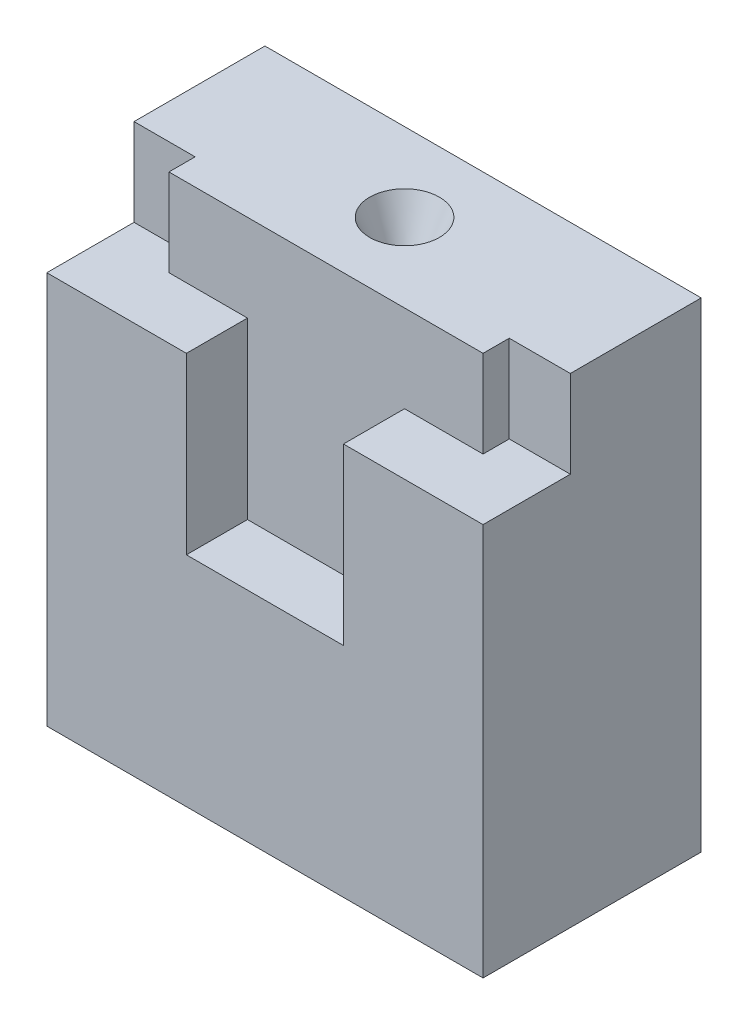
ISO-10303-21;
HEADER;
FILE_DESCRIPTION(('STEP AP214'),'2;1');
FILE_NAME('part.step','',(''),(''),'','','');
FILE_SCHEMA(('AUTOMOTIVE_DESIGN { 1 0 10303 214 1 1 1 1 }'));
ENDSEC;
DATA;
#1=APPLICATION_CONTEXT('core data for automotive mechanical design processes');
#2=APPLICATION_PROTOCOL_DEFINITION('international standard','automotive_design',2000,#1);
#3=PRODUCT_CONTEXT('',#1,'mechanical');
#4=PRODUCT('Part','Part','',(#3));
#5=PRODUCT_RELATED_PRODUCT_CATEGORY('part','',(#4));
#6=PRODUCT_DEFINITION_FORMATION('','',#4);
#7=PRODUCT_DEFINITION_CONTEXT('part definition',#1,'design');
#8=PRODUCT_DEFINITION('design','',#6,#7);
#9=PRODUCT_DEFINITION_SHAPE('','',#8);
#10=(LENGTH_UNIT() NAMED_UNIT(*) SI_UNIT(.MILLI.,.METRE.));
#11=(NAMED_UNIT(*) PLANE_ANGLE_UNIT() SI_UNIT($,.RADIAN.));
#12=(NAMED_UNIT(*) SI_UNIT($,.STERADIAN.) SOLID_ANGLE_UNIT());
#13=UNCERTAINTY_MEASURE_WITH_UNIT(LENGTH_MEASURE(1.E-05),#10,'distance_accuracy_value','');
#14=(GEOMETRIC_REPRESENTATION_CONTEXT(3) GLOBAL_UNCERTAINTY_ASSIGNED_CONTEXT((#13)) GLOBAL_UNIT_ASSIGNED_CONTEXT((#10,
#11,#12)) REPRESENTATION_CONTEXT('',''));
#15=CARTESIAN_POINT('',(0.,0.,0.));
#16=DIRECTION('',(0.,0.,1.));
#17=DIRECTION('',(1.,0.,0.));
#18=AXIS2_PLACEMENT_3D('',#15,#16,#17);
#19=CARTESIAN_POINT('',(-25.,55.,12.5));
#20=DIRECTION('',(0.,1.,0.));
#21=DIRECTION('',(0.,0.,1.));
#22=AXIS2_PLACEMENT_3D('',#19,#20,#21);
#23=PLANE('',#22);
#24=DIRECTION('',(-1.,0.,0.));
#25=VECTOR('',#24,1.);
#26=CARTESIAN_POINT('',(-9.,55.,5.5));
#27=LINE('',#26,#25);
#28=CARTESIAN_POINT('',(18.,55.,5.5));
#29=VERTEX_POINT('',#28);
#30=CARTESIAN_POINT('',(-18.,55.,5.5));
#31=VERTEX_POINT('',#30);
#32=EDGE_CURVE('E193',#29,#31,#27,.T.);
#33=ORIENTED_EDGE('',*,*,#32,.F.);
#34=DIRECTION('',(0.,0.,1.));
#35=VECTOR('',#34,1.);
#36=CARTESIAN_POINT('',(18.,55.,5.5));
#37=LINE('',#36,#35);
#38=CARTESIAN_POINT('',(18.,55.,2.5));
#39=VERTEX_POINT('',#38);
#40=EDGE_CURVE('E146',#39,#29,#37,.T.);
#41=ORIENTED_EDGE('',*,*,#40,.F.);
#42=DIRECTION('',(-1.,0.,0.));
#43=VECTOR('',#42,1.);
#44=CARTESIAN_POINT('',(18.,55.,2.5));
#45=LINE('',#44,#43);
#46=CARTESIAN_POINT('',(25.,55.,2.5));
#47=VERTEX_POINT('',#46);
#48=EDGE_CURVE('E143',#47,#39,#45,.T.);
#49=ORIENTED_EDGE('',*,*,#48,.F.);
#50=DIRECTION('',(0.,0.,-1.));
#51=VECTOR('',#50,1.);
#52=CARTESIAN_POINT('',(25.,55.,-12.5));
#53=LINE('',#52,#51);
#54=CARTESIAN_POINT('',(25.,55.,-12.5));
#55=VERTEX_POINT('',#54);
#56=EDGE_CURVE('E227',#47,#55,#53,.T.);
#57=ORIENTED_EDGE('',*,*,#56,.T.);
#58=DIRECTION('',(-1.,0.,0.));
#59=VECTOR('',#58,1.);
#60=CARTESIAN_POINT('',(-25.,55.,-12.5));
#61=LINE('',#60,#59);
#62=CARTESIAN_POINT('',(-25.,55.,-12.5));
#63=VERTEX_POINT('',#62);
#64=EDGE_CURVE('E230',#55,#63,#61,.T.);
#65=ORIENTED_EDGE('',*,*,#64,.T.);
#66=DIRECTION('',(0.,0.,1.));
#67=VECTOR('',#66,1.);
#68=CARTESIAN_POINT('',(-25.,55.,-12.5));
#69=LINE('',#68,#67);
#70=CARTESIAN_POINT('',(-25.,55.,2.5));
#71=VERTEX_POINT('',#70);
#72=EDGE_CURVE('E224',#63,#71,#69,.T.);
#73=ORIENTED_EDGE('',*,*,#72,.T.);
#74=DIRECTION('',(-1.,0.,0.));
#75=VECTOR('',#74,1.);
#76=CARTESIAN_POINT('',(-18.,55.,2.5));
#77=LINE('',#76,#75);
#78=CARTESIAN_POINT('',(-18.,55.,2.5));
#79=VERTEX_POINT('',#78);
#80=EDGE_CURVE('E174',#79,#71,#77,.T.);
#81=ORIENTED_EDGE('',*,*,#80,.F.);
#82=DIRECTION('',(0.,0.,-1.));
#83=VECTOR('',#82,1.);
#84=CARTESIAN_POINT('',(-18.,55.,5.5));
#85=LINE('',#84,#83);
#86=EDGE_CURVE('E168',#31,#79,#85,.T.);
#87=ORIENTED_EDGE('',*,*,#86,.F.);
#88=EDGE_LOOP('',(#33,#41,#49,#57,#65,#73,#81,#87));
#89=FACE_BOUND('',#88,.T.);
#90=CARTESIAN_POINT('',(0.,55.,-3.5));
#91=DIRECTION('',(0.,-1.,0.));
#92=DIRECTION('',(0.,0.,-1.));
#93=AXIS2_PLACEMENT_3D('',#90,#91,#92);
#94=CIRCLE('',#93,4.);
#95=CARTESIAN_POINT('',(0.,55.,-7.5));
#96=VERTEX_POINT('',#95);
#97=EDGE_CURVE('E141',#96,#96,#94,.T.);
#98=ORIENTED_EDGE('',*,*,#97,.T.);
#99=EDGE_LOOP('',(#98));
#100=FACE_BOUND('',#99,.T.);
#101=ADVANCED_FACE('F31',(#89,#100),#23,.T.);
#102=CARTESIAN_POINT('',(-25.,55.,-12.5));
#103=DIRECTION('',(1.,0.,0.));
#104=DIRECTION('',(0.,0.,-1.));
#105=AXIS2_PLACEMENT_3D('',#102,#103,#104);
#106=PLANE('',#105);
#107=DIRECTION('',(0.,0.,1.));
#108=VECTOR('',#107,1.);
#109=CARTESIAN_POINT('',(-25.,45.,2.5));
#110=LINE('',#109,#108);
#111=CARTESIAN_POINT('',(-25.,45.,2.5));
#112=VERTEX_POINT('',#111);
#113=CARTESIAN_POINT('',(-25.,45.,12.5));
#114=VERTEX_POINT('',#113);
#115=EDGE_CURVE('E182',#112,#114,#110,.T.);
#116=ORIENTED_EDGE('',*,*,#115,.F.);
#117=DIRECTION('',(0.,1.,0.));
#118=VECTOR('',#117,1.);
#119=CARTESIAN_POINT('',(-25.,45.,2.5));
#120=LINE('',#119,#118);
#121=EDGE_CURVE('E190',#112,#71,#120,.T.);
#122=ORIENTED_EDGE('',*,*,#121,.T.);
#123=ORIENTED_EDGE('',*,*,#72,.F.);
#124=DIRECTION('',(0.,-1.,0.));
#125=VECTOR('',#124,1.);
#126=CARTESIAN_POINT('',(-25.,55.,-12.5));
#127=LINE('',#126,#125);
#128=CARTESIAN_POINT('',(-25.,0.,-12.5));
#129=VERTEX_POINT('',#128);
#130=EDGE_CURVE('E232',#63,#129,#127,.T.);
#131=ORIENTED_EDGE('',*,*,#130,.T.);
#132=DIRECTION('',(0.,0.,1.));
#133=VECTOR('',#132,1.);
#134=CARTESIAN_POINT('',(-25.,0.,-12.5));
#135=LINE('',#134,#133);
#136=CARTESIAN_POINT('',(-25.,0.,12.5));
#137=VERTEX_POINT('',#136);
#138=EDGE_CURVE('E215',#129,#137,#135,.T.);
#139=ORIENTED_EDGE('',*,*,#138,.T.);
#140=DIRECTION('',(0.,-1.,0.));
#141=VECTOR('',#140,1.);
#142=CARTESIAN_POINT('',(-25.,55.,12.5));
#143=LINE('',#142,#141);
#144=EDGE_CURVE('E11',#114,#137,#143,.T.);
#145=ORIENTED_EDGE('',*,*,#144,.F.);
#146=EDGE_LOOP('',(#116,#122,#123,#131,#139,#145));
#147=FACE_BOUND('',#146,.T.);
#148=ADVANCED_FACE('F33',(#147),#106,.F.);
#149=CARTESIAN_POINT('',(-25.,55.,12.5));
#150=DIRECTION('',(0.,0.,-1.));
#151=DIRECTION('',(-1.,0.,0.));
#152=AXIS2_PLACEMENT_3D('',#149,#150,#151);
#153=PLANE('',#152);
#154=DIRECTION('',(0.,-1.,0.));
#155=VECTOR('',#154,1.);
#156=CARTESIAN_POINT('',(25.,55.,12.5));
#157=LINE('',#156,#155);
#158=CARTESIAN_POINT('',(25.,45.,12.5));
#159=VERTEX_POINT('',#158);
#160=CARTESIAN_POINT('',(25.,0.,12.5));
#161=VERTEX_POINT('',#160);
#162=EDGE_CURVE('E39',#159,#161,#157,.T.);
#163=ORIENTED_EDGE('',*,*,#162,.F.);
#164=DIRECTION('',(1.,0.,0.));
#165=VECTOR('',#164,1.);
#166=CARTESIAN_POINT('',(25.,45.,12.5));
#167=LINE('',#166,#165);
#168=CARTESIAN_POINT('',(9.,45.,12.5));
#169=VERTEX_POINT('',#168);
#170=EDGE_CURVE('E149',#169,#159,#167,.T.);
#171=ORIENTED_EDGE('',*,*,#170,.F.);
#172=DIRECTION('',(0.,1.,0.));
#173=VECTOR('',#172,1.);
#174=CARTESIAN_POINT('',(9.,25.,12.5));
#175=LINE('',#174,#173);
#176=CARTESIAN_POINT('',(9.,25.,12.5));
#177=VERTEX_POINT('',#176);
#178=EDGE_CURVE('E219',#177,#169,#175,.T.);
#179=ORIENTED_EDGE('',*,*,#178,.F.);
#180=DIRECTION('',(1.,0.,0.));
#181=VECTOR('',#180,1.);
#182=CARTESIAN_POINT('',(-9.,25.,12.5));
#183=LINE('',#182,#181);
#184=CARTESIAN_POINT('',(-9.,25.,12.5));
#185=VERTEX_POINT('',#184);
#186=EDGE_CURVE('E201',#185,#177,#183,.T.);
#187=ORIENTED_EDGE('',*,*,#186,.F.);
#188=DIRECTION('',(0.,1.,0.));
#189=VECTOR('',#188,1.);
#190=CARTESIAN_POINT('',(-9.,25.,12.5));
#191=LINE('',#190,#189);
#192=CARTESIAN_POINT('',(-9.,45.,12.5));
#193=VERTEX_POINT('',#192);
#194=EDGE_CURVE('E210',#185,#193,#191,.T.);
#195=ORIENTED_EDGE('',*,*,#194,.T.);
#196=DIRECTION('',(1.,0.,0.));
#197=VECTOR('',#196,1.);
#198=CARTESIAN_POINT('',(-25.,45.,12.5));
#199=LINE('',#198,#197);
#200=EDGE_CURVE('E184',#114,#193,#199,.T.);
#201=ORIENTED_EDGE('',*,*,#200,.F.);
#202=ORIENTED_EDGE('',*,*,#144,.T.);
#203=DIRECTION('',(1.,0.,0.));
#204=VECTOR('',#203,1.);
#205=CARTESIAN_POINT('',(-25.,0.,12.5));
#206=LINE('',#205,#204);
#207=EDGE_CURVE('E235',#137,#161,#206,.T.);
#208=ORIENTED_EDGE('',*,*,#207,.T.);
#209=EDGE_LOOP('',(#163,#171,#179,#187,#195,#201,#202,#208));
#210=FACE_BOUND('',#209,.T.);
#211=ADVANCED_FACE('F256',(#210),#153,.F.);
#212=CARTESIAN_POINT('',(25.,55.,-12.5));
#213=DIRECTION('',(-1.,0.,0.));
#214=DIRECTION('',(0.,0.,1.));
#215=AXIS2_PLACEMENT_3D('',#212,#213,#214);
#216=PLANE('',#215);
#217=ORIENTED_EDGE('',*,*,#56,.F.);
#218=DIRECTION('',(0.,1.,0.));
#219=VECTOR('',#218,1.);
#220=CARTESIAN_POINT('',(25.,45.,2.5));
#221=LINE('',#220,#219);
#222=CARTESIAN_POINT('',(25.,45.,2.5));
#223=VERTEX_POINT('',#222);
#224=EDGE_CURVE('E161',#223,#47,#221,.T.);
#225=ORIENTED_EDGE('',*,*,#224,.F.);
#226=DIRECTION('',(0.,0.,-1.));
#227=VECTOR('',#226,1.);
#228=CARTESIAN_POINT('',(25.,45.,2.5));
#229=LINE('',#228,#227);
#230=EDGE_CURVE('E151',#159,#223,#229,.T.);
#231=ORIENTED_EDGE('',*,*,#230,.F.);
#232=ORIENTED_EDGE('',*,*,#162,.T.);
#233=DIRECTION('',(0.,0.,-1.));
#234=VECTOR('',#233,1.);
#235=CARTESIAN_POINT('',(25.,0.,-12.5));
#236=LINE('',#235,#234);
#237=CARTESIAN_POINT('',(25.,0.,-12.5));
#238=VERTEX_POINT('',#237);
#239=EDGE_CURVE('E238',#161,#238,#236,.T.);
#240=ORIENTED_EDGE('',*,*,#239,.T.);
#241=DIRECTION('',(0.,-1.,0.));
#242=VECTOR('',#241,1.);
#243=CARTESIAN_POINT('',(25.,55.,-12.5));
#244=LINE('',#243,#242);
#245=EDGE_CURVE('E243',#55,#238,#244,.T.);
#246=ORIENTED_EDGE('',*,*,#245,.F.);
#247=EDGE_LOOP('',(#217,#225,#231,#232,#240,#246));
#248=FACE_BOUND('',#247,.T.);
#249=ADVANCED_FACE('F249',(#248),#216,.F.);
#250=CARTESIAN_POINT('',(-25.,55.,-12.5));
#251=DIRECTION('',(0.,0.,1.));
#252=DIRECTION('',(1.,0.,0.));
#253=AXIS2_PLACEMENT_3D('',#250,#251,#252);
#254=PLANE('',#253);
#255=DIRECTION('',(-1.,0.,0.));
#256=VECTOR('',#255,1.);
#257=CARTESIAN_POINT('',(-25.,0.,-12.5));
#258=LINE('',#257,#256);
#259=EDGE_CURVE('E228',#238,#129,#258,.T.);
#260=ORIENTED_EDGE('',*,*,#259,.T.);
#261=ORIENTED_EDGE('',*,*,#130,.F.);
#262=ORIENTED_EDGE('',*,*,#64,.F.);
#263=ORIENTED_EDGE('',*,*,#245,.T.);
#264=EDGE_LOOP('',(#260,#261,#262,#263));
#265=FACE_BOUND('',#264,.T.);
#266=ADVANCED_FACE('F265',(#265),#254,.F.);
#267=CARTESIAN_POINT('',(-25.,0.,12.5));
#268=DIRECTION('',(0.,1.,0.));
#269=DIRECTION('',(0.,0.,1.));
#270=AXIS2_PLACEMENT_3D('',#267,#268,#269);
#271=PLANE('',#270);
#272=ORIENTED_EDGE('',*,*,#138,.F.);
#273=ORIENTED_EDGE('',*,*,#259,.F.);
#274=ORIENTED_EDGE('',*,*,#239,.F.);
#275=ORIENTED_EDGE('',*,*,#207,.F.);
#276=EDGE_LOOP('',(#272,#273,#274,#275));
#277=FACE_BOUND('',#276,.T.);
#278=ADVANCED_FACE('F262',(#277),#271,.F.);
#279=CARTESIAN_POINT('',(-9.,25.,5.5));
#280=DIRECTION('',(-1.,0.,0.));
#281=DIRECTION('',(0.,0.,1.));
#282=AXIS2_PLACEMENT_3D('',#279,#280,#281);
#283=PLANE('',#282);
#284=DIRECTION('',(0.,1.,0.));
#285=VECTOR('',#284,1.);
#286=CARTESIAN_POINT('',(-9.,25.,5.5));
#287=LINE('',#286,#285);
#288=CARTESIAN_POINT('',(-9.,25.,5.5));
#289=VERTEX_POINT('',#288);
#290=CARTESIAN_POINT('',(-9.,45.,5.5));
#291=VERTEX_POINT('',#290);
#292=EDGE_CURVE('E212',#289,#291,#287,.T.);
#293=ORIENTED_EDGE('',*,*,#292,.T.);
#294=DIRECTION('',(0.,0.,-1.));
#295=VECTOR('',#294,1.);
#296=CARTESIAN_POINT('',(-9.,45.,12.5));
#297=LINE('',#296,#295);
#298=EDGE_CURVE('E54',#193,#291,#297,.T.);
#299=ORIENTED_EDGE('',*,*,#298,.F.);
#300=ORIENTED_EDGE('',*,*,#194,.F.);
#301=DIRECTION('',(0.,0.,1.));
#302=VECTOR('',#301,1.);
#303=CARTESIAN_POINT('',(-9.,25.,5.5));
#304=LINE('',#303,#302);
#305=EDGE_CURVE('E198',#289,#185,#304,.T.);
#306=ORIENTED_EDGE('',*,*,#305,.F.);
#307=EDGE_LOOP('',(#293,#299,#300,#306));
#308=FACE_BOUND('',#307,.T.);
#309=ADVANCED_FACE('F287',(#308),#283,.F.);
#310=CARTESIAN_POINT('',(-9.,25.,5.5));
#311=DIRECTION('',(0.,0.,-1.));
#312=DIRECTION('',(-1.,0.,0.));
#313=AXIS2_PLACEMENT_3D('',#310,#311,#312);
#314=PLANE('',#313);
#315=ORIENTED_EDGE('',*,*,#32,.T.);
#316=DIRECTION('',(0.,1.,0.));
#317=VECTOR('',#316,1.);
#318=CARTESIAN_POINT('',(-18.,45.,5.5));
#319=LINE('',#318,#317);
#320=CARTESIAN_POINT('',(-18.,45.,5.5));
#321=VERTEX_POINT('',#320);
#322=EDGE_CURVE('E186',#321,#31,#319,.T.);
#323=ORIENTED_EDGE('',*,*,#322,.F.);
#324=DIRECTION('',(-1.,0.,0.));
#325=VECTOR('',#324,1.);
#326=CARTESIAN_POINT('',(-9.,45.,5.5));
#327=LINE('',#326,#325);
#328=EDGE_CURVE('E173',#291,#321,#327,.T.);
#329=ORIENTED_EDGE('',*,*,#328,.F.);
#330=ORIENTED_EDGE('',*,*,#292,.F.);
#331=DIRECTION('',(-1.,0.,0.));
#332=VECTOR('',#331,1.);
#333=CARTESIAN_POINT('',(-9.,25.,5.5));
#334=LINE('',#333,#332);
#335=CARTESIAN_POINT('',(9.,25.,5.49999999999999));
#336=VERTEX_POINT('',#335);
#337=EDGE_CURVE('E207',#336,#289,#334,.T.);
#338=ORIENTED_EDGE('',*,*,#337,.F.);
#339=DIRECTION('',(0.,1.,0.));
#340=VECTOR('',#339,1.);
#341=CARTESIAN_POINT('',(9.,25.,5.49999999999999));
#342=LINE('',#341,#340);
#343=CARTESIAN_POINT('',(9.,45.,5.49999999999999));
#344=VERTEX_POINT('',#343);
#345=EDGE_CURVE('E216',#336,#344,#342,.T.);
#346=ORIENTED_EDGE('',*,*,#345,.T.);
#347=DIRECTION('',(-1.,0.,0.));
#348=VECTOR('',#347,1.);
#349=CARTESIAN_POINT('',(9.,45.,5.5));
#350=LINE('',#349,#348);
#351=CARTESIAN_POINT('',(18.,45.,5.5));
#352=VERTEX_POINT('',#351);
#353=EDGE_CURVE('E46',#352,#344,#350,.T.);
#354=ORIENTED_EDGE('',*,*,#353,.F.);
#355=DIRECTION('',(0.,1.,0.));
#356=VECTOR('',#355,1.);
#357=CARTESIAN_POINT('',(18.,45.,5.5));
#358=LINE('',#357,#356);
#359=EDGE_CURVE('E165',#352,#29,#358,.T.);
#360=ORIENTED_EDGE('',*,*,#359,.T.);
#361=EDGE_LOOP('',(#315,#323,#329,#330,#338,#346,#354,#360));
#362=FACE_BOUND('',#361,.T.);
#363=ADVANCED_FACE('F289',(#362),#314,.F.);
#364=CARTESIAN_POINT('',(9.,25.,5.49999999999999));
#365=DIRECTION('',(1.,0.,0.));
#366=DIRECTION('',(0.,0.,-1.));
#367=AXIS2_PLACEMENT_3D('',#364,#365,#366);
#368=PLANE('',#367);
#369=ORIENTED_EDGE('',*,*,#178,.T.);
#370=DIRECTION('',(0.,0.,1.));
#371=VECTOR('',#370,1.);
#372=CARTESIAN_POINT('',(9.,45.,12.5));
#373=LINE('',#372,#371);
#374=EDGE_CURVE('E160',#344,#169,#373,.T.);
#375=ORIENTED_EDGE('',*,*,#374,.F.);
#376=ORIENTED_EDGE('',*,*,#345,.F.);
#377=DIRECTION('',(0.,0.,-1.));
#378=VECTOR('',#377,1.);
#379=CARTESIAN_POINT('',(9.,25.,5.49999999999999));
#380=LINE('',#379,#378);
#381=EDGE_CURVE('E204',#177,#336,#380,.T.);
#382=ORIENTED_EDGE('',*,*,#381,.F.);
#383=EDGE_LOOP('',(#369,#375,#376,#382));
#384=FACE_BOUND('',#383,.T.);
#385=ADVANCED_FACE('F281',(#384),#368,.F.);
#386=CARTESIAN_POINT('',(-9.,25.,12.5));
#387=DIRECTION('',(0.,1.,0.));
#388=DIRECTION('',(0.,0.,1.));
#389=AXIS2_PLACEMENT_3D('',#386,#387,#388);
#390=PLANE('',#389);
#391=ORIENTED_EDGE('',*,*,#305,.T.);
#392=ORIENTED_EDGE('',*,*,#186,.T.);
#393=ORIENTED_EDGE('',*,*,#381,.T.);
#394=ORIENTED_EDGE('',*,*,#337,.T.);
#395=EDGE_LOOP('',(#391,#392,#393,#394));
#396=FACE_BOUND('',#395,.T.);
#397=ADVANCED_FACE('F284',(#396),#390,.T.);
#398=CARTESIAN_POINT('',(-18.,45.,2.5));
#399=DIRECTION('',(0.,0.,-1.));
#400=DIRECTION('',(-1.,0.,0.));
#401=AXIS2_PLACEMENT_3D('',#398,#399,#400);
#402=PLANE('',#401);
#403=ORIENTED_EDGE('',*,*,#80,.T.);
#404=ORIENTED_EDGE('',*,*,#121,.F.);
#405=DIRECTION('',(-1.,0.,0.));
#406=VECTOR('',#405,1.);
#407=CARTESIAN_POINT('',(-18.,45.,2.5));
#408=LINE('',#407,#406);
#409=CARTESIAN_POINT('',(-18.,45.,2.5));
#410=VERTEX_POINT('',#409);
#411=EDGE_CURVE('E179',#410,#112,#408,.T.);
#412=ORIENTED_EDGE('',*,*,#411,.F.);
#413=DIRECTION('',(0.,1.,0.));
#414=VECTOR('',#413,1.);
#415=CARTESIAN_POINT('',(-18.,45.,2.5));
#416=LINE('',#415,#414);
#417=EDGE_CURVE('E194',#410,#79,#416,.T.);
#418=ORIENTED_EDGE('',*,*,#417,.T.);
#419=EDGE_LOOP('',(#403,#404,#412,#418));
#420=FACE_BOUND('',#419,.T.);
#421=ADVANCED_FACE('F296',(#420),#402,.F.);
#422=CARTESIAN_POINT('',(-18.,45.,5.5));
#423=DIRECTION('',(1.,0.,0.));
#424=DIRECTION('',(0.,0.,-1.));
#425=AXIS2_PLACEMENT_3D('',#422,#423,#424);
#426=PLANE('',#425);
#427=ORIENTED_EDGE('',*,*,#86,.T.);
#428=ORIENTED_EDGE('',*,*,#417,.F.);
#429=DIRECTION('',(0.,0.,-1.));
#430=VECTOR('',#429,1.);
#431=CARTESIAN_POINT('',(-18.,45.,5.5));
#432=LINE('',#431,#430);
#433=EDGE_CURVE('E176',#321,#410,#432,.T.);
#434=ORIENTED_EDGE('',*,*,#433,.F.);
#435=ORIENTED_EDGE('',*,*,#322,.T.);
#436=EDGE_LOOP('',(#427,#428,#434,#435));
#437=FACE_BOUND('',#436,.T.);
#438=ADVANCED_FACE('F294',(#437),#426,.F.);
#439=CARTESIAN_POINT('',(-9.,45.,12.5));
#440=DIRECTION('',(0.,-1.,0.));
#441=DIRECTION('',(0.,0.,-1.));
#442=AXIS2_PLACEMENT_3D('',#439,#440,#441);
#443=PLANE('',#442);
#444=ORIENTED_EDGE('',*,*,#298,.T.);
#445=ORIENTED_EDGE('',*,*,#328,.T.);
#446=ORIENTED_EDGE('',*,*,#433,.T.);
#447=ORIENTED_EDGE('',*,*,#411,.T.);
#448=ORIENTED_EDGE('',*,*,#115,.T.);
#449=ORIENTED_EDGE('',*,*,#200,.T.);
#450=EDGE_LOOP('',(#444,#445,#446,#447,#448,#449));
#451=FACE_BOUND('',#450,.T.);
#452=ADVANCED_FACE('F291',(#451),#443,.F.);
#453=CARTESIAN_POINT('',(18.,45.,5.5));
#454=DIRECTION('',(-1.,0.,0.));
#455=DIRECTION('',(0.,0.,1.));
#456=AXIS2_PLACEMENT_3D('',#453,#454,#455);
#457=PLANE('',#456);
#458=ORIENTED_EDGE('',*,*,#40,.T.);
#459=ORIENTED_EDGE('',*,*,#359,.F.);
#460=DIRECTION('',(0.,0.,1.));
#461=VECTOR('',#460,1.);
#462=CARTESIAN_POINT('',(18.,45.,5.5));
#463=LINE('',#462,#461);
#464=CARTESIAN_POINT('',(18.,45.,2.5));
#465=VERTEX_POINT('',#464);
#466=EDGE_CURVE('E157',#465,#352,#463,.T.);
#467=ORIENTED_EDGE('',*,*,#466,.F.);
#468=DIRECTION('',(0.,1.,0.));
#469=VECTOR('',#468,1.);
#470=CARTESIAN_POINT('',(18.,45.,2.5));
#471=LINE('',#470,#469);
#472=EDGE_CURVE('E169',#465,#39,#471,.T.);
#473=ORIENTED_EDGE('',*,*,#472,.T.);
#474=EDGE_LOOP('',(#458,#459,#467,#473));
#475=FACE_BOUND('',#474,.T.);
#476=ADVANCED_FACE('F399',(#475),#457,.F.);
#477=CARTESIAN_POINT('',(18.,45.,2.5));
#478=DIRECTION('',(0.,0.,-1.));
#479=DIRECTION('',(-1.,0.,0.));
#480=AXIS2_PLACEMENT_3D('',#477,#478,#479);
#481=PLANE('',#480);
#482=ORIENTED_EDGE('',*,*,#48,.T.);
#483=ORIENTED_EDGE('',*,*,#472,.F.);
#484=DIRECTION('',(-1.,0.,0.));
#485=VECTOR('',#484,1.);
#486=CARTESIAN_POINT('',(18.,45.,2.5));
#487=LINE('',#486,#485);
#488=EDGE_CURVE('E154',#223,#465,#487,.T.);
#489=ORIENTED_EDGE('',*,*,#488,.F.);
#490=ORIENTED_EDGE('',*,*,#224,.T.);
#491=EDGE_LOOP('',(#482,#483,#489,#490));
#492=FACE_BOUND('',#491,.T.);
#493=ADVANCED_FACE('F276',(#492),#481,.F.);
#494=CARTESIAN_POINT('',(9.,45.,12.5));
#495=DIRECTION('',(0.,-1.,0.));
#496=DIRECTION('',(0.,0.,-1.));
#497=AXIS2_PLACEMENT_3D('',#494,#495,#496);
#498=PLANE('',#497);
#499=ORIENTED_EDGE('',*,*,#170,.T.);
#500=ORIENTED_EDGE('',*,*,#230,.T.);
#501=ORIENTED_EDGE('',*,*,#488,.T.);
#502=ORIENTED_EDGE('',*,*,#466,.T.);
#503=ORIENTED_EDGE('',*,*,#353,.T.);
#504=ORIENTED_EDGE('',*,*,#374,.T.);
#505=EDGE_LOOP('',(#499,#500,#501,#502,#503,#504));
#506=FACE_BOUND('',#505,.T.);
#507=ADVANCED_FACE('F137',(#506),#498,.F.);
#508=CARTESIAN_POINT('',(0.,55.,-3.5));
#509=DIRECTION('',(0.,1.,0.));
#510=DIRECTION('',(0.,0.,1.));
#511=AXIS2_PLACEMENT_3D('',#508,#509,#510);
#512=CONICAL_SURFACE('',#511,4.,0.400770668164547);
#513=CARTESIAN_POINT('',(0.,45.5594013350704,-3.5));
#514=VERTEX_POINT('',#513);
#515=VERTEX_LOOP('',#514);
#516=FACE_BOUND('',#515,.T.);
#517=ORIENTED_EDGE('',*,*,#97,.F.);
#518=EDGE_LOOP('',(#517));
#519=FACE_BOUND('',#518,.T.);
#520=ADVANCED_FACE('F134',(#516,#519),#512,.F.);
#521=CLOSED_SHELL('',(#101,#148,#211,#249,#266,#278,#309,#363,#385,#397,#421,#438,#452,#476,
#493,#507,#520));
#522=MANIFOLD_SOLID_BREP('B2',#521);
#523=ADVANCED_BREP_SHAPE_REPRESENTATION('',(#18,#522),#14);
#524=SHAPE_DEFINITION_REPRESENTATION(#9,#523);
ENDSEC;
END-ISO-10303-21;
